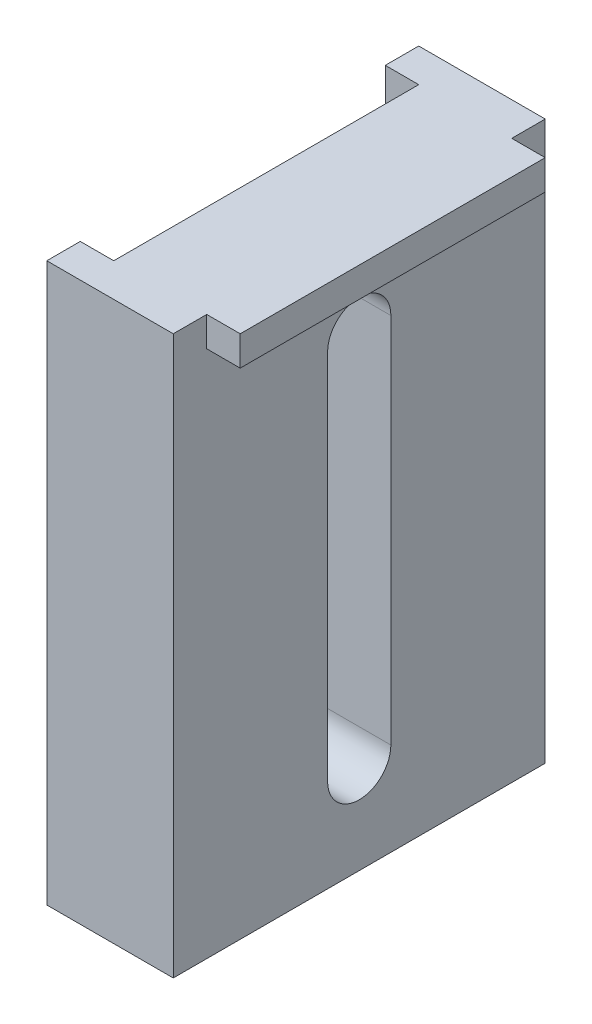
ISO-10303-21;
HEADER;
FILE_DESCRIPTION(('STEP AP214'),'2;1');
FILE_NAME('part.step','',(''),(''),'','','');
FILE_SCHEMA(('AUTOMOTIVE_DESIGN { 1 0 10303 214 1 1 1 1 }'));
ENDSEC;
DATA;
#1=APPLICATION_CONTEXT('core data for automotive mechanical design processes');
#2=APPLICATION_PROTOCOL_DEFINITION('international standard','automotive_design',2000,#1);
#3=PRODUCT_CONTEXT('',#1,'mechanical');
#4=PRODUCT('Part','Part','',(#3));
#5=PRODUCT_RELATED_PRODUCT_CATEGORY('part','',(#4));
#6=PRODUCT_DEFINITION_FORMATION('','',#4);
#7=PRODUCT_DEFINITION_CONTEXT('part definition',#1,'design');
#8=PRODUCT_DEFINITION('design','',#6,#7);
#9=PRODUCT_DEFINITION_SHAPE('','',#8);
#10=(LENGTH_UNIT() NAMED_UNIT(*) SI_UNIT(.MILLI.,.METRE.));
#11=(NAMED_UNIT(*) PLANE_ANGLE_UNIT() SI_UNIT($,.RADIAN.));
#12=(NAMED_UNIT(*) SI_UNIT($,.STERADIAN.) SOLID_ANGLE_UNIT());
#13=UNCERTAINTY_MEASURE_WITH_UNIT(LENGTH_MEASURE(1.E-05),#10,'distance_accuracy_value','');
#14=(GEOMETRIC_REPRESENTATION_CONTEXT(3) GLOBAL_UNCERTAINTY_ASSIGNED_CONTEXT((#13)) GLOBAL_UNIT_ASSIGNED_CONTEXT((#10,
#11,#12)) REPRESENTATION_CONTEXT('',''));
#15=CARTESIAN_POINT('',(0.,0.,0.));
#16=DIRECTION('',(0.,0.,1.));
#17=DIRECTION('',(1.,0.,0.));
#18=AXIS2_PLACEMENT_3D('',#15,#16,#17);
#19=CARTESIAN_POINT('',(-17.,75.,25.));
#20=DIRECTION('',(1.,0.,0.));
#21=DIRECTION('',(0.,1.,0.));
#22=AXIS2_PLACEMENT_3D('',#19,#20,#21);
#23=PLANE('',#22);
#24=DIRECTION('',(0.,-1.,0.));
#25=VECTOR('',#24,1.);
#26=CARTESIAN_POINT('',(-17.,0.,-20.5));
#27=LINE('',#26,#25);
#28=CARTESIAN_POINT('',(-17.,75.,-20.5));
#29=VERTEX_POINT('',#28);
#30=CARTESIAN_POINT('',(-17.,0.,-20.5));
#31=VERTEX_POINT('',#30);
#32=EDGE_CURVE('E260',#29,#31,#27,.T.);
#33=ORIENTED_EDGE('',*,*,#32,.F.);
#34=DIRECTION('',(0.,0.,-1.));
#35=VECTOR('',#34,1.);
#36=CARTESIAN_POINT('',(-17.,75.,25.));
#37=LINE('',#36,#35);
#38=CARTESIAN_POINT('',(-17.,75.,-25.));
#39=VERTEX_POINT('',#38);
#40=EDGE_CURVE('E203',#29,#39,#37,.T.);
#41=ORIENTED_EDGE('',*,*,#40,.T.);
#42=DIRECTION('',(0.,-1.,0.));
#43=VECTOR('',#42,1.);
#44=CARTESIAN_POINT('',(-17.,75.,-25.));
#45=LINE('',#44,#43);
#46=CARTESIAN_POINT('',(-17.,0.,-25.));
#47=VERTEX_POINT('',#46);
#48=EDGE_CURVE('E220',#39,#47,#45,.T.);
#49=ORIENTED_EDGE('',*,*,#48,.T.);
#50=DIRECTION('',(0.,0.,-1.));
#51=VECTOR('',#50,1.);
#52=CARTESIAN_POINT('',(-17.,0.,25.));
#53=LINE('',#52,#51);
#54=EDGE_CURVE('E208',#31,#47,#53,.T.);
#55=ORIENTED_EDGE('',*,*,#54,.F.);
#56=EDGE_LOOP('',(#33,#41,#49,#55));
#57=FACE_BOUND('',#56,.T.);
#58=ADVANCED_FACE('F40',(#57),#23,.F.);
#59=CARTESIAN_POINT('',(-17.,0.,25.));
#60=DIRECTION('',(0.,1.,0.));
#61=DIRECTION('',(0.,0.,1.));
#62=AXIS2_PLACEMENT_3D('',#59,#60,#61);
#63=PLANE('',#62);
#64=DIRECTION('',(0.,0.,1.));
#65=VECTOR('',#64,1.);
#66=CARTESIAN_POINT('',(-15.,0.,-20.5));
#67=LINE('',#66,#65);
#68=CARTESIAN_POINT('',(-15.,0.,-20.5));
#69=VERTEX_POINT('',#68);
#70=CARTESIAN_POINT('',(-15.,0.,20.5));
#71=VERTEX_POINT('',#70);
#72=EDGE_CURVE('E249',#69,#71,#67,.T.);
#73=ORIENTED_EDGE('',*,*,#72,.F.);
#74=DIRECTION('',(-1.,0.,0.));
#75=VECTOR('',#74,1.);
#76=CARTESIAN_POINT('',(-15.,0.,-20.5));
#77=LINE('',#76,#75);
#78=EDGE_CURVE('E235',#69,#31,#77,.T.);
#79=ORIENTED_EDGE('',*,*,#78,.T.);
#80=ORIENTED_EDGE('',*,*,#54,.T.);
#81=DIRECTION('',(1.,0.,0.));
#82=VECTOR('',#81,1.);
#83=CARTESIAN_POINT('',(-17.,0.,-25.));
#84=LINE('',#83,#82);
#85=CARTESIAN_POINT('',(0.,0.,-25.));
#86=VERTEX_POINT('',#85);
#87=EDGE_CURVE('E230',#47,#86,#84,.T.);
#88=ORIENTED_EDGE('',*,*,#87,.T.);
#89=DIRECTION('',(0.,0.,-1.));
#90=VECTOR('',#89,1.);
#91=CARTESIAN_POINT('',(0.,0.,25.));
#92=LINE('',#91,#90);
#93=CARTESIAN_POINT('',(0.,0.,25.));
#94=VERTEX_POINT('',#93);
#95=EDGE_CURVE('E11',#94,#86,#92,.T.);
#96=ORIENTED_EDGE('',*,*,#95,.F.);
#97=DIRECTION('',(1.,0.,0.));
#98=VECTOR('',#97,1.);
#99=CARTESIAN_POINT('',(-17.,0.,25.));
#100=LINE('',#99,#98);
#101=CARTESIAN_POINT('',(-17.,0.,25.));
#102=VERTEX_POINT('',#101);
#103=EDGE_CURVE('E217',#102,#94,#100,.T.);
#104=ORIENTED_EDGE('',*,*,#103,.F.);
#105=CARTESIAN_POINT('',(-17.,0.,20.5));
#106=VERTEX_POINT('',#105);
#107=EDGE_CURVE('E204',#102,#106,#53,.T.);
#108=ORIENTED_EDGE('',*,*,#107,.T.);
#109=DIRECTION('',(-1.,0.,0.));
#110=VECTOR('',#109,1.);
#111=CARTESIAN_POINT('',(-15.,0.,20.5));
#112=LINE('',#111,#110);
#113=EDGE_CURVE('E234',#71,#106,#112,.T.);
#114=ORIENTED_EDGE('',*,*,#113,.F.);
#115=EDGE_LOOP('',(#73,#79,#80,#88,#96,#104,#108,#114));
#116=FACE_BOUND('',#115,.T.);
#117=ADVANCED_FACE('F42',(#116),#63,.F.);
#118=CARTESIAN_POINT('',(0.,0.,25.));
#119=DIRECTION('',(-1.,0.,0.));
#120=DIRECTION('',(0.,-1.,0.));
#121=AXIS2_PLACEMENT_3D('',#118,#119,#120);
#122=PLANE('',#121);
#123=DIRECTION('',(0.,-1.,0.));
#124=VECTOR('',#123,1.);
#125=CARTESIAN_POINT('',(0.,62.5,4.25));
#126=LINE('',#125,#124);
#127=CARTESIAN_POINT('',(0.,62.5,4.25));
#128=VERTEX_POINT('',#127);
#129=CARTESIAN_POINT('',(0.,12.5,4.25));
#130=VERTEX_POINT('',#129);
#131=EDGE_CURVE('E329',#128,#130,#126,.T.);
#132=ORIENTED_EDGE('',*,*,#131,.F.);
#133=CARTESIAN_POINT('',(0.,62.5,0.));
#134=DIRECTION('',(-1.,0.,0.));
#135=DIRECTION('',(0.,-1.,0.));
#136=AXIS2_PLACEMENT_3D('',#133,#134,#135);
#137=CIRCLE('',#136,4.25);
#138=CARTESIAN_POINT('',(0.,62.5,-4.25));
#139=VERTEX_POINT('',#138);
#140=EDGE_CURVE('E325',#139,#128,#137,.F.);
#141=ORIENTED_EDGE('',*,*,#140,.F.);
#142=DIRECTION('',(0.,1.,0.));
#143=VECTOR('',#142,1.);
#144=CARTESIAN_POINT('',(0.,62.5,-4.25));
#145=LINE('',#144,#143);
#146=CARTESIAN_POINT('',(0.,12.5,-4.25));
#147=VERTEX_POINT('',#146);
#148=EDGE_CURVE('E294',#147,#139,#145,.T.);
#149=ORIENTED_EDGE('',*,*,#148,.F.);
#150=CARTESIAN_POINT('',(0.,12.5,0.));
#151=DIRECTION('',(-1.,0.,0.));
#152=DIRECTION('',(0.,-1.,0.));
#153=AXIS2_PLACEMENT_3D('',#150,#151,#152);
#154=CIRCLE('',#153,4.25);
#155=EDGE_CURVE('E64',#130,#147,#154,.F.);
#156=ORIENTED_EDGE('',*,*,#155,.F.);
#157=EDGE_LOOP('',(#132,#141,#149,#156));
#158=FACE_BOUND('',#157,.T.);
#159=DIRECTION('',(0.,1.,0.));
#160=VECTOR('',#159,1.);
#161=CARTESIAN_POINT('',(0.,0.,-25.));
#162=LINE('',#161,#160);
#163=CARTESIAN_POINT('',(0.,75.,-25.));
#164=VERTEX_POINT('',#163);
#165=EDGE_CURVE('E227',#86,#164,#162,.T.);
#166=ORIENTED_EDGE('',*,*,#165,.T.);
#167=DIRECTION('',(0.,0.,-1.));
#168=VECTOR('',#167,1.);
#169=CARTESIAN_POINT('',(0.,75.,-25.));
#170=LINE('',#169,#168);
#171=CARTESIAN_POINT('',(0.,75.,-20.5));
#172=VERTEX_POINT('',#171);
#173=EDGE_CURVE('E345',#172,#164,#170,.T.);
#174=ORIENTED_EDGE('',*,*,#173,.F.);
#175=DIRECTION('',(0.,-1.,0.));
#176=VECTOR('',#175,1.);
#177=CARTESIAN_POINT('',(0.,75.,-20.5));
#178=LINE('',#177,#176);
#179=CARTESIAN_POINT('',(0.,71.,-20.5));
#180=VERTEX_POINT('',#179);
#181=EDGE_CURVE('E189',#172,#180,#178,.T.);
#182=ORIENTED_EDGE('',*,*,#181,.T.);
#183=DIRECTION('',(0.,0.,-1.));
#184=VECTOR('',#183,1.);
#185=CARTESIAN_POINT('',(0.,71.,25.));
#186=LINE('',#185,#184);
#187=CARTESIAN_POINT('',(0.,71.,20.5));
#188=VERTEX_POINT('',#187);
#189=EDGE_CURVE('E49',#188,#180,#186,.T.);
#190=ORIENTED_EDGE('',*,*,#189,.F.);
#191=DIRECTION('',(0.,-1.,0.));
#192=VECTOR('',#191,1.);
#193=CARTESIAN_POINT('',(0.,75.,20.5));
#194=LINE('',#193,#192);
#195=CARTESIAN_POINT('',(0.,75.,20.5));
#196=VERTEX_POINT('',#195);
#197=EDGE_CURVE('E165',#196,#188,#194,.T.);
#198=ORIENTED_EDGE('',*,*,#197,.F.);
#199=DIRECTION('',(0.,0.,-1.));
#200=VECTOR('',#199,1.);
#201=CARTESIAN_POINT('',(0.,75.,25.));
#202=LINE('',#201,#200);
#203=CARTESIAN_POINT('',(0.,75.,25.));
#204=VERTEX_POINT('',#203);
#205=EDGE_CURVE('E185',#204,#196,#202,.T.);
#206=ORIENTED_EDGE('',*,*,#205,.F.);
#207=DIRECTION('',(0.,1.,0.));
#208=VECTOR('',#207,1.);
#209=CARTESIAN_POINT('',(0.,0.,25.));
#210=LINE('',#209,#208);
#211=EDGE_CURVE('E56',#94,#204,#210,.T.);
#212=ORIENTED_EDGE('',*,*,#211,.F.);
#213=ORIENTED_EDGE('',*,*,#95,.T.);
#214=EDGE_LOOP('',(#166,#174,#182,#190,#198,#206,#212,#213));
#215=FACE_BOUND('',#214,.T.);
#216=ADVANCED_FACE('F187',(#158,#215),#122,.F.);
#217=CARTESIAN_POINT('',(0.,71.,25.));
#218=DIRECTION('',(0.,1.,0.));
#219=DIRECTION('',(0.,0.,1.));
#220=AXIS2_PLACEMENT_3D('',#217,#218,#219);
#221=PLANE('',#220);
#222=DIRECTION('',(0.,0.,-1.));
#223=VECTOR('',#222,1.);
#224=CARTESIAN_POINT('',(4.49999999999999,71.,25.));
#225=LINE('',#224,#223);
#226=CARTESIAN_POINT('',(4.49999999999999,71.,20.5));
#227=VERTEX_POINT('',#226);
#228=CARTESIAN_POINT('',(4.5,71.,-20.5));
#229=VERTEX_POINT('',#228);
#230=EDGE_CURVE('E183',#227,#229,#225,.T.);
#231=ORIENTED_EDGE('',*,*,#230,.F.);
#232=DIRECTION('',(1.,0.,0.));
#233=VECTOR('',#232,1.);
#234=CARTESIAN_POINT('',(0.,71.,20.5));
#235=LINE('',#234,#233);
#236=EDGE_CURVE('E168',#188,#227,#235,.T.);
#237=ORIENTED_EDGE('',*,*,#236,.F.);
#238=ORIENTED_EDGE('',*,*,#189,.T.);
#239=DIRECTION('',(-1.,0.,0.));
#240=VECTOR('',#239,1.);
#241=CARTESIAN_POINT('',(0.,71.,-20.5));
#242=LINE('',#241,#240);
#243=EDGE_CURVE('E349',#229,#180,#242,.T.);
#244=ORIENTED_EDGE('',*,*,#243,.F.);
#245=EDGE_LOOP('',(#231,#237,#238,#244));
#246=FACE_BOUND('',#245,.T.);
#247=ADVANCED_FACE('F180',(#246),#221,.F.);
#248=CARTESIAN_POINT('',(4.49999999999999,71.,25.));
#249=DIRECTION('',(-1.,0.,0.));
#250=DIRECTION('',(0.,-1.,0.));
#251=AXIS2_PLACEMENT_3D('',#248,#249,#250);
#252=PLANE('',#251);
#253=DIRECTION('',(0.,0.,-1.));
#254=VECTOR('',#253,1.);
#255=CARTESIAN_POINT('',(4.5,75.,25.));
#256=LINE('',#255,#254);
#257=CARTESIAN_POINT('',(4.49999999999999,75.,20.5));
#258=VERTEX_POINT('',#257);
#259=CARTESIAN_POINT('',(4.5,75.,-20.5));
#260=VERTEX_POINT('',#259);
#261=EDGE_CURVE('E195',#258,#260,#256,.T.);
#262=ORIENTED_EDGE('',*,*,#261,.F.);
#263=DIRECTION('',(0.,-1.,0.));
#264=VECTOR('',#263,1.);
#265=CARTESIAN_POINT('',(4.49999999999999,75.,20.5));
#266=LINE('',#265,#264);
#267=EDGE_CURVE('E176',#258,#227,#266,.T.);
#268=ORIENTED_EDGE('',*,*,#267,.T.);
#269=ORIENTED_EDGE('',*,*,#230,.T.);
#270=DIRECTION('',(0.,-1.,0.));
#271=VECTOR('',#270,1.);
#272=CARTESIAN_POINT('',(4.5,75.,-20.5));
#273=LINE('',#272,#271);
#274=EDGE_CURVE('E335',#260,#229,#273,.T.);
#275=ORIENTED_EDGE('',*,*,#274,.F.);
#276=EDGE_LOOP('',(#262,#268,#269,#275));
#277=FACE_BOUND('',#276,.T.);
#278=ADVANCED_FACE('F382',(#277),#252,.F.);
#279=CARTESIAN_POINT('',(4.5,75.,25.));
#280=DIRECTION('',(0.,-1.,0.));
#281=DIRECTION('',(0.,0.,-1.));
#282=AXIS2_PLACEMENT_3D('',#279,#280,#281);
#283=PLANE('',#282);
#284=DIRECTION('',(-1.,0.,0.));
#285=VECTOR('',#284,1.);
#286=CARTESIAN_POINT('',(4.5,75.,25.));
#287=LINE('',#286,#285);
#288=CARTESIAN_POINT('',(-17.,75.,25.));
#289=VERTEX_POINT('',#288);
#290=EDGE_CURVE('E212',#204,#289,#287,.T.);
#291=ORIENTED_EDGE('',*,*,#290,.F.);
#292=ORIENTED_EDGE('',*,*,#205,.T.);
#293=DIRECTION('',(1.,0.,0.));
#294=VECTOR('',#293,1.);
#295=CARTESIAN_POINT('',(0.,75.,20.5));
#296=LINE('',#295,#294);
#297=EDGE_CURVE('E171',#196,#258,#296,.T.);
#298=ORIENTED_EDGE('',*,*,#297,.T.);
#299=ORIENTED_EDGE('',*,*,#261,.T.);
#300=DIRECTION('',(-1.,0.,0.));
#301=VECTOR('',#300,1.);
#302=CARTESIAN_POINT('',(0.,75.,-20.5));
#303=LINE('',#302,#301);
#304=EDGE_CURVE('E339',#260,#172,#303,.T.);
#305=ORIENTED_EDGE('',*,*,#304,.T.);
#306=ORIENTED_EDGE('',*,*,#173,.T.);
#307=DIRECTION('',(-1.,0.,0.));
#308=VECTOR('',#307,1.);
#309=CARTESIAN_POINT('',(4.5,75.,-25.));
#310=LINE('',#309,#308);
#311=EDGE_CURVE('E224',#164,#39,#310,.T.);
#312=ORIENTED_EDGE('',*,*,#311,.T.);
#313=ORIENTED_EDGE('',*,*,#40,.F.);
#314=DIRECTION('',(-1.,0.,0.));
#315=VECTOR('',#314,1.);
#316=CARTESIAN_POINT('',(-12.5,75.,-20.5));
#317=LINE('',#316,#315);
#318=CARTESIAN_POINT('',(-12.5,75.,-20.5));
#319=VERTEX_POINT('',#318);
#320=EDGE_CURVE('E263',#319,#29,#317,.T.);
#321=ORIENTED_EDGE('',*,*,#320,.F.);
#322=DIRECTION('',(0.,0.,-1.));
#323=VECTOR('',#322,1.);
#324=CARTESIAN_POINT('',(-12.5,75.,-20.5));
#325=LINE('',#324,#323);
#326=CARTESIAN_POINT('',(-12.5,75.,20.5));
#327=VERTEX_POINT('',#326);
#328=EDGE_CURVE('E268',#327,#319,#325,.T.);
#329=ORIENTED_EDGE('',*,*,#328,.F.);
#330=DIRECTION('',(-1.,0.,0.));
#331=VECTOR('',#330,1.);
#332=CARTESIAN_POINT('',(-12.5,75.,20.5));
#333=LINE('',#332,#331);
#334=CARTESIAN_POINT('',(-17.,75.,20.5));
#335=VERTEX_POINT('',#334);
#336=EDGE_CURVE('E272',#327,#335,#333,.T.);
#337=ORIENTED_EDGE('',*,*,#336,.T.);
#338=EDGE_CURVE('E199',#289,#335,#37,.T.);
#339=ORIENTED_EDGE('',*,*,#338,.F.);
#340=EDGE_LOOP('',(#291,#292,#298,#299,#305,#306,#312,#313,#321,#329,#337,#339));
#341=FACE_BOUND('',#340,.T.);
#342=ADVANCED_FACE('F359',(#341),#283,.F.);
#343=ORIENTED_EDGE('',*,*,#338,.T.);
#344=DIRECTION('',(0.,1.,0.));
#345=VECTOR('',#344,1.);
#346=CARTESIAN_POINT('',(-17.,0.,20.5));
#347=LINE('',#346,#345);
#348=EDGE_CURVE('E257',#106,#335,#347,.T.);
#349=ORIENTED_EDGE('',*,*,#348,.F.);
#350=ORIENTED_EDGE('',*,*,#107,.F.);
#351=DIRECTION('',(0.,-1.,0.));
#352=VECTOR('',#351,1.);
#353=CARTESIAN_POINT('',(-17.,75.,25.));
#354=LINE('',#353,#352);
#355=EDGE_CURVE('E209',#289,#102,#354,.T.);
#356=ORIENTED_EDGE('',*,*,#355,.F.);
#357=EDGE_LOOP('',(#343,#349,#350,#356));
#358=FACE_BOUND('',#357,.T.);
#359=ADVANCED_FACE('F389',(#358),#23,.F.);
#360=CARTESIAN_POINT('',(0.,0.,25.));
#361=DIRECTION('',(0.,0.,1.));
#362=DIRECTION('',(1.,0.,0.));
#363=AXIS2_PLACEMENT_3D('',#360,#361,#362);
#364=PLANE('',#363);
#365=ORIENTED_EDGE('',*,*,#211,.T.);
#366=ORIENTED_EDGE('',*,*,#290,.T.);
#367=ORIENTED_EDGE('',*,*,#355,.T.);
#368=ORIENTED_EDGE('',*,*,#103,.T.);
#369=EDGE_LOOP('',(#365,#366,#367,#368));
#370=FACE_BOUND('',#369,.T.);
#371=ADVANCED_FACE('F364',(#370),#364,.T.);
#372=CARTESIAN_POINT('',(0.,0.,-25.));
#373=DIRECTION('',(0.,0.,1.));
#374=DIRECTION('',(1.,0.,0.));
#375=AXIS2_PLACEMENT_3D('',#372,#373,#374);
#376=PLANE('',#375);
#377=ORIENTED_EDGE('',*,*,#311,.F.);
#378=ORIENTED_EDGE('',*,*,#165,.F.);
#379=ORIENTED_EDGE('',*,*,#87,.F.);
#380=ORIENTED_EDGE('',*,*,#48,.F.);
#381=EDGE_LOOP('',(#377,#378,#379,#380));
#382=FACE_BOUND('',#381,.T.);
#383=ADVANCED_FACE('F374',(#382),#376,.F.);
#384=CARTESIAN_POINT('',(-15.,0.,-20.5));
#385=DIRECTION('',(0.,0.,-1.));
#386=DIRECTION('',(-1.,0.,0.));
#387=AXIS2_PLACEMENT_3D('',#384,#385,#386);
#388=PLANE('',#387);
#389=ORIENTED_EDGE('',*,*,#32,.T.);
#390=ORIENTED_EDGE('',*,*,#78,.F.);
#391=DIRECTION('',(0.,-1.,0.));
#392=VECTOR('',#391,1.);
#393=CARTESIAN_POINT('',(-15.,0.,-20.5));
#394=LINE('',#393,#392);
#395=CARTESIAN_POINT('',(-15.,71.,-20.5));
#396=VERTEX_POINT('',#395);
#397=EDGE_CURVE('E253',#396,#69,#394,.T.);
#398=ORIENTED_EDGE('',*,*,#397,.F.);
#399=DIRECTION('',(-1.,0.,0.));
#400=VECTOR('',#399,1.);
#401=CARTESIAN_POINT('',(-12.5,71.,-20.5));
#402=LINE('',#401,#400);
#403=CARTESIAN_POINT('',(-12.5,71.,-20.5));
#404=VERTEX_POINT('',#403);
#405=EDGE_CURVE('E264',#404,#396,#402,.T.);
#406=ORIENTED_EDGE('',*,*,#405,.F.);
#407=DIRECTION('',(0.,-1.,0.));
#408=VECTOR('',#407,1.);
#409=CARTESIAN_POINT('',(-12.5,71.,-20.5));
#410=LINE('',#409,#408);
#411=EDGE_CURVE('E290',#319,#404,#410,.T.);
#412=ORIENTED_EDGE('',*,*,#411,.F.);
#413=ORIENTED_EDGE('',*,*,#320,.T.);
#414=EDGE_LOOP('',(#389,#390,#398,#406,#412,#413));
#415=FACE_BOUND('',#414,.T.);
#416=ADVANCED_FACE('F422',(#415),#388,.F.);
#417=CARTESIAN_POINT('',(-15.,0.,20.5));
#418=DIRECTION('',(0.,0.,1.));
#419=DIRECTION('',(1.,0.,0.));
#420=AXIS2_PLACEMENT_3D('',#417,#418,#419);
#421=PLANE('',#420);
#422=ORIENTED_EDGE('',*,*,#348,.T.);
#423=ORIENTED_EDGE('',*,*,#336,.F.);
#424=DIRECTION('',(0.,1.,0.));
#425=VECTOR('',#424,1.);
#426=CARTESIAN_POINT('',(-12.5,71.,20.5));
#427=LINE('',#426,#425);
#428=CARTESIAN_POINT('',(-12.5,71.,20.5));
#429=VERTEX_POINT('',#428);
#430=EDGE_CURVE('E282',#429,#327,#427,.T.);
#431=ORIENTED_EDGE('',*,*,#430,.F.);
#432=DIRECTION('',(-1.,0.,0.));
#433=VECTOR('',#432,1.);
#434=CARTESIAN_POINT('',(-12.5,71.,20.5));
#435=LINE('',#434,#433);
#436=CARTESIAN_POINT('',(-15.,71.,20.5));
#437=VERTEX_POINT('',#436);
#438=EDGE_CURVE('E267',#429,#437,#435,.T.);
#439=ORIENTED_EDGE('',*,*,#438,.T.);
#440=DIRECTION('',(0.,1.,0.));
#441=VECTOR('',#440,1.);
#442=CARTESIAN_POINT('',(-15.,0.,20.5));
#443=LINE('',#442,#441);
#444=EDGE_CURVE('E245',#71,#437,#443,.T.);
#445=ORIENTED_EDGE('',*,*,#444,.F.);
#446=ORIENTED_EDGE('',*,*,#113,.T.);
#447=EDGE_LOOP('',(#422,#423,#431,#439,#445,#446));
#448=FACE_BOUND('',#447,.T.);
#449=ADVANCED_FACE('F409',(#448),#421,.F.);
#450=CARTESIAN_POINT('',(-15.,71.,-20.5));
#451=DIRECTION('',(1.,0.,0.));
#452=DIRECTION('',(0.,1.,0.));
#453=AXIS2_PLACEMENT_3D('',#450,#451,#452);
#454=PLANE('',#453);
#455=DIRECTION('',(0.,-1.,0.));
#456=VECTOR('',#455,1.);
#457=CARTESIAN_POINT('',(-14.9999999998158,62.5,-4.25));
#458=LINE('',#457,#456);
#459=CARTESIAN_POINT('',(-15.,62.5,-4.25));
#460=VERTEX_POINT('',#459);
#461=CARTESIAN_POINT('',(-14.9999999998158,12.5,-4.25));
#462=VERTEX_POINT('',#461);
#463=EDGE_CURVE('E318',#460,#462,#458,.T.);
#464=ORIENTED_EDGE('',*,*,#463,.F.);
#465=CARTESIAN_POINT('',(-14.9999999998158,62.5,0.));
#466=DIRECTION('',(-1.,0.,0.));
#467=DIRECTION('',(0.,-1.,0.));
#468=AXIS2_PLACEMENT_3D('',#465,#466,#467);
#469=CIRCLE('',#468,4.25);
#470=CARTESIAN_POINT('',(-14.9999999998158,62.5,4.25));
#471=VERTEX_POINT('',#470);
#472=EDGE_CURVE('E322',#471,#460,#469,.T.);
#473=ORIENTED_EDGE('',*,*,#472,.F.);
#474=DIRECTION('',(0.,1.,0.));
#475=VECTOR('',#474,1.);
#476=CARTESIAN_POINT('',(-14.9999999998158,62.5,4.25));
#477=LINE('',#476,#475);
#478=CARTESIAN_POINT('',(-14.9999999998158,12.5,4.25));
#479=VERTEX_POINT('',#478);
#480=EDGE_CURVE('E303',#479,#471,#477,.T.);
#481=ORIENTED_EDGE('',*,*,#480,.F.);
#482=CARTESIAN_POINT('',(-14.9999999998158,12.5,0.));
#483=DIRECTION('',(-1.,0.,0.));
#484=DIRECTION('',(0.,-1.,0.));
#485=AXIS2_PLACEMENT_3D('',#482,#483,#484);
#486=CIRCLE('',#485,4.25);
#487=EDGE_CURVE('E314',#462,#479,#486,.T.);
#488=ORIENTED_EDGE('',*,*,#487,.F.);
#489=EDGE_LOOP('',(#464,#473,#481,#488));
#490=FACE_BOUND('',#489,.T.);
#491=ORIENTED_EDGE('',*,*,#397,.T.);
#492=ORIENTED_EDGE('',*,*,#72,.T.);
#493=ORIENTED_EDGE('',*,*,#444,.T.);
#494=DIRECTION('',(0.,0.,-1.));
#495=VECTOR('',#494,1.);
#496=CARTESIAN_POINT('',(-15.,71.,-20.5));
#497=LINE('',#496,#495);
#498=EDGE_CURVE('E239',#437,#396,#497,.T.);
#499=ORIENTED_EDGE('',*,*,#498,.T.);
#500=EDGE_LOOP('',(#491,#492,#493,#499));
#501=FACE_BOUND('',#500,.T.);
#502=ADVANCED_FACE('F417',(#490,#501),#454,.F.);
#503=CARTESIAN_POINT('',(-12.5,71.,-20.5));
#504=DIRECTION('',(0.,-1.,0.));
#505=DIRECTION('',(1.,0.,0.));
#506=AXIS2_PLACEMENT_3D('',#503,#504,#505);
#507=PLANE('',#506);
#508=ORIENTED_EDGE('',*,*,#438,.F.);
#509=DIRECTION('',(0.,0.,1.));
#510=VECTOR('',#509,1.);
#511=CARTESIAN_POINT('',(-12.5,71.,-20.5));
#512=LINE('',#511,#510);
#513=EDGE_CURVE('E286',#404,#429,#512,.T.);
#514=ORIENTED_EDGE('',*,*,#513,.F.);
#515=ORIENTED_EDGE('',*,*,#405,.T.);
#516=ORIENTED_EDGE('',*,*,#498,.F.);
#517=EDGE_LOOP('',(#508,#514,#515,#516));
#518=FACE_BOUND('',#517,.T.);
#519=ADVANCED_FACE('F414',(#518),#507,.F.);
#520=CARTESIAN_POINT('',(-12.5,75.,-20.5));
#521=DIRECTION('',(1.,0.,0.));
#522=DIRECTION('',(0.,0.,-1.));
#523=AXIS2_PLACEMENT_3D('',#520,#521,#522);
#524=PLANE('',#523);
#525=ORIENTED_EDGE('',*,*,#411,.T.);
#526=ORIENTED_EDGE('',*,*,#513,.T.);
#527=ORIENTED_EDGE('',*,*,#430,.T.);
#528=ORIENTED_EDGE('',*,*,#328,.T.);
#529=EDGE_LOOP('',(#525,#526,#527,#528));
#530=FACE_BOUND('',#529,.T.);
#531=ADVANCED_FACE('F411',(#530),#524,.F.);
#532=CARTESIAN_POINT('',(4.501,62.5,0.));
#533=DIRECTION('',(-1.,0.,0.));
#534=DIRECTION('',(0.,-1.,0.));
#535=AXIS2_PLACEMENT_3D('',#532,#533,#534);
#536=CYLINDRICAL_SURFACE('',#535,4.25);
#537=ORIENTED_EDGE('',*,*,#140,.T.);
#538=DIRECTION('',(-1.,0.,0.));
#539=VECTOR('',#538,1.);
#540=CARTESIAN_POINT('',(4.501,62.5,4.25));
#541=LINE('',#540,#539);
#542=EDGE_CURVE('E298',#128,#471,#541,.T.);
#543=ORIENTED_EDGE('',*,*,#542,.T.);
#544=ORIENTED_EDGE('',*,*,#472,.T.);
#545=DIRECTION('',(-1.,0.,0.));
#546=VECTOR('',#545,1.);
#547=CARTESIAN_POINT('',(4.501,62.5,-4.25));
#548=LINE('',#547,#546);
#549=EDGE_CURVE('E299',#139,#460,#548,.T.);
#550=ORIENTED_EDGE('',*,*,#549,.F.);
#551=EDGE_LOOP('',(#537,#543,#544,#550));
#552=FACE_BOUND('',#551,.T.);
#553=ADVANCED_FACE('F439',(#552),#536,.F.);
#554=CARTESIAN_POINT('',(4.501,62.5,4.25));
#555=DIRECTION('',(0.,0.,1.));
#556=DIRECTION('',(1.,0.,0.));
#557=AXIS2_PLACEMENT_3D('',#554,#555,#556);
#558=PLANE('',#557);
#559=ORIENTED_EDGE('',*,*,#131,.T.);
#560=DIRECTION('',(-1.,0.,0.));
#561=VECTOR('',#560,1.);
#562=CARTESIAN_POINT('',(4.50100000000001,12.5,4.25));
#563=LINE('',#562,#561);
#564=EDGE_CURVE('E306',#130,#479,#563,.T.);
#565=ORIENTED_EDGE('',*,*,#564,.T.);
#566=ORIENTED_EDGE('',*,*,#480,.T.);
#567=ORIENTED_EDGE('',*,*,#542,.F.);
#568=EDGE_LOOP('',(#559,#565,#566,#567));
#569=FACE_BOUND('',#568,.T.);
#570=ADVANCED_FACE('F442',(#569),#558,.F.);
#571=CARTESIAN_POINT('',(4.50100000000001,12.5,0.));
#572=DIRECTION('',(-1.,0.,0.));
#573=DIRECTION('',(0.,-1.,0.));
#574=AXIS2_PLACEMENT_3D('',#571,#572,#573);
#575=CYLINDRICAL_SURFACE('',#574,4.25);
#576=ORIENTED_EDGE('',*,*,#155,.T.);
#577=DIRECTION('',(-1.,0.,0.));
#578=VECTOR('',#577,1.);
#579=CARTESIAN_POINT('',(4.50100000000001,12.5,-4.25));
#580=LINE('',#579,#578);
#581=EDGE_CURVE('E302',#147,#462,#580,.T.);
#582=ORIENTED_EDGE('',*,*,#581,.T.);
#583=ORIENTED_EDGE('',*,*,#487,.T.);
#584=ORIENTED_EDGE('',*,*,#564,.F.);
#585=EDGE_LOOP('',(#576,#582,#583,#584));
#586=FACE_BOUND('',#585,.T.);
#587=ADVANCED_FACE('F447',(#586),#575,.F.);
#588=CARTESIAN_POINT('',(4.501,62.5,-4.25));
#589=DIRECTION('',(0.,0.,-1.));
#590=DIRECTION('',(-1.,0.,0.));
#591=AXIS2_PLACEMENT_3D('',#588,#589,#590);
#592=PLANE('',#591);
#593=ORIENTED_EDGE('',*,*,#148,.T.);
#594=ORIENTED_EDGE('',*,*,#549,.T.);
#595=ORIENTED_EDGE('',*,*,#463,.T.);
#596=ORIENTED_EDGE('',*,*,#581,.F.);
#597=EDGE_LOOP('',(#593,#594,#595,#596));
#598=FACE_BOUND('',#597,.T.);
#599=ADVANCED_FACE('F444',(#598),#592,.F.);
#600=CARTESIAN_POINT('',(0.,75.,-20.5));
#601=DIRECTION('',(0.,0.,1.));
#602=DIRECTION('',(1.,0.,0.));
#603=AXIS2_PLACEMENT_3D('',#600,#601,#602);
#604=PLANE('',#603);
#605=ORIENTED_EDGE('',*,*,#243,.T.);
#606=ORIENTED_EDGE('',*,*,#181,.F.);
#607=ORIENTED_EDGE('',*,*,#304,.F.);
#608=ORIENTED_EDGE('',*,*,#274,.T.);
#609=EDGE_LOOP('',(#605,#606,#607,#608));
#610=FACE_BOUND('',#609,.T.);
#611=ADVANCED_FACE('F380',(#610),#604,.F.);
#612=CARTESIAN_POINT('',(0.,75.,20.5));
#613=DIRECTION('',(0.,0.,-1.));
#614=DIRECTION('',(-1.,0.,0.));
#615=AXIS2_PLACEMENT_3D('',#612,#613,#614);
#616=PLANE('',#615);
#617=ORIENTED_EDGE('',*,*,#236,.T.);
#618=ORIENTED_EDGE('',*,*,#267,.F.);
#619=ORIENTED_EDGE('',*,*,#297,.F.);
#620=ORIENTED_EDGE('',*,*,#197,.T.);
#621=EDGE_LOOP('',(#617,#618,#619,#620));
#622=FACE_BOUND('',#621,.T.);
#623=ADVANCED_FACE('F167',(#622),#616,.F.);
#624=CLOSED_SHELL('',(#58,#117,#216,#247,#278,#342,#359,#371,#383,#416,#449,#502,#519,#531,#553,
#570,#587,#599,#611,#623));
#625=MANIFOLD_SOLID_BREP('B2',#624);
#626=ADVANCED_BREP_SHAPE_REPRESENTATION('',(#18,#625),#14);
#627=SHAPE_DEFINITION_REPRESENTATION(#9,#626);
ENDSEC;
END-ISO-10303-21;
